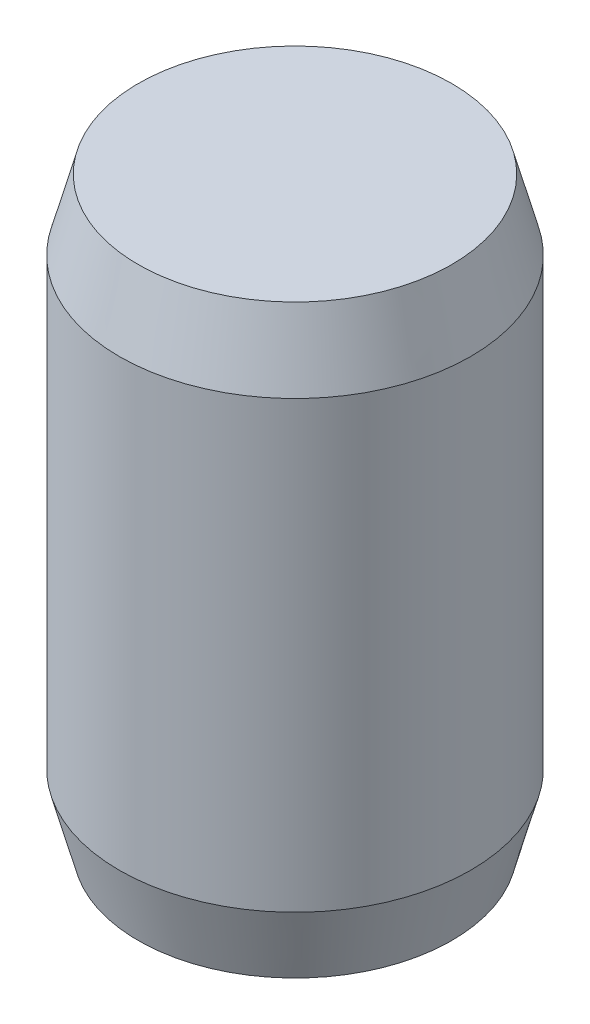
ISO-10303-21;
HEADER;
FILE_DESCRIPTION(('STEP AP214'),'2;1');
FILE_NAME('part.step','',(''),(''),'','','');
FILE_SCHEMA(('AUTOMOTIVE_DESIGN { 1 0 10303 214 1 1 1 1 }'));
ENDSEC;
DATA;
#1=APPLICATION_CONTEXT('core data for automotive mechanical design processes');
#2=APPLICATION_PROTOCOL_DEFINITION('international standard','automotive_design',2000,#1);
#3=PRODUCT_CONTEXT('',#1,'mechanical');
#4=PRODUCT('Part','Part','',(#3));
#5=PRODUCT_RELATED_PRODUCT_CATEGORY('part','',(#4));
#6=PRODUCT_DEFINITION_FORMATION('','',#4);
#7=PRODUCT_DEFINITION_CONTEXT('part definition',#1,'design');
#8=PRODUCT_DEFINITION('design','',#6,#7);
#9=PRODUCT_DEFINITION_SHAPE('','',#8);
#10=(LENGTH_UNIT() NAMED_UNIT(*) SI_UNIT(.MILLI.,.METRE.));
#11=(NAMED_UNIT(*) PLANE_ANGLE_UNIT() SI_UNIT($,.RADIAN.));
#12=(NAMED_UNIT(*) SI_UNIT($,.STERADIAN.) SOLID_ANGLE_UNIT());
#13=UNCERTAINTY_MEASURE_WITH_UNIT(LENGTH_MEASURE(1.E-05),#10,'distance_accuracy_value','');
#14=(GEOMETRIC_REPRESENTATION_CONTEXT(3) GLOBAL_UNCERTAINTY_ASSIGNED_CONTEXT((#13)) GLOBAL_UNIT_ASSIGNED_CONTEXT((#10,
#11,#12)) REPRESENTATION_CONTEXT('',''));
#15=CARTESIAN_POINT('',(0.,0.,0.));
#16=DIRECTION('',(0.,0.,1.));
#17=DIRECTION('',(1.,0.,0.));
#18=AXIS2_PLACEMENT_3D('',#15,#16,#17);
#19=CARTESIAN_POINT('',(0.,-10.,0.));
#20=DIRECTION('',(0.,1.,0.));
#21=DIRECTION('',(0.,0.,1.));
#22=AXIS2_PLACEMENT_3D('',#19,#20,#21);
#23=CONICAL_SURFACE('',#22,2.67846096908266,0.261799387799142);
#24=CARTESIAN_POINT('',(0.,-8.8,0.));
#25=DIRECTION('',(0.,-1.,0.));
#26=DIRECTION('',(0.,0.,-1.));
#27=AXIS2_PLACEMENT_3D('',#24,#25,#26);
#28=CIRCLE('',#27,3.);
#29=CARTESIAN_POINT('',(0.,-8.8,-3.));
#30=VERTEX_POINT('',#29);
#31=EDGE_CURVE('E10',#30,#30,#28,.T.);
#32=ORIENTED_EDGE('',*,*,#31,.T.);
#33=EDGE_LOOP('',(#32));
#34=FACE_BOUND('',#33,.T.);
#35=CARTESIAN_POINT('',(0.,-10.,0.));
#36=DIRECTION('',(0.,-1.,0.));
#37=DIRECTION('',(0.,0.,-1.));
#38=AXIS2_PLACEMENT_3D('',#35,#36,#37);
#39=CIRCLE('',#38,2.67846096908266);
#40=CARTESIAN_POINT('',(0.,-10.,-2.67846096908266));
#41=VERTEX_POINT('',#40);
#42=EDGE_CURVE('E47',#41,#41,#39,.T.);
#43=ORIENTED_EDGE('',*,*,#42,.F.);
#44=EDGE_LOOP('',(#43));
#45=FACE_BOUND('',#44,.T.);
#46=ADVANCED_FACE('F33',(#34,#45),#23,.T.);
#47=CARTESIAN_POINT('',(0.,0.,0.));
#48=DIRECTION('',(0.,-1.,0.));
#49=DIRECTION('',(0.,0.,-1.));
#50=AXIS2_PLACEMENT_3D('',#47,#48,#49);
#51=CYLINDRICAL_SURFACE('',#50,3.);
#52=CARTESIAN_POINT('',(0.,-1.2,0.));
#53=DIRECTION('',(0.,-1.,0.));
#54=DIRECTION('',(0.,0.,-1.));
#55=AXIS2_PLACEMENT_3D('',#52,#53,#54);
#56=CIRCLE('',#55,3.00000000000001);
#57=CARTESIAN_POINT('',(0.,-1.2,-3.00000000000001));
#58=VERTEX_POINT('',#57);
#59=EDGE_CURVE('E39',#58,#58,#56,.T.);
#60=ORIENTED_EDGE('',*,*,#59,.T.);
#61=EDGE_LOOP('',(#60));
#62=FACE_BOUND('',#61,.T.);
#63=ORIENTED_EDGE('',*,*,#31,.F.);
#64=EDGE_LOOP('',(#63));
#65=FACE_BOUND('',#64,.T.);
#66=ADVANCED_FACE('F56',(#62,#65),#51,.T.);
#67=CARTESIAN_POINT('',(0.,-1.2,0.));
#68=DIRECTION('',(0.,-1.,0.));
#69=DIRECTION('',(0.,0.,-1.));
#70=AXIS2_PLACEMENT_3D('',#67,#68,#69);
#71=CONICAL_SURFACE('',#70,3.00000000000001,0.26179938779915);
#72=CARTESIAN_POINT('',(0.,0.,0.));
#73=DIRECTION('',(0.,-1.,0.));
#74=DIRECTION('',(0.,0.,-1.));
#75=AXIS2_PLACEMENT_3D('',#72,#73,#74);
#76=CIRCLE('',#75,2.67846096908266);
#77=CARTESIAN_POINT('',(0.,0.,-2.67846096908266));
#78=VERTEX_POINT('',#77);
#79=EDGE_CURVE('E43',#78,#78,#76,.T.);
#80=ORIENTED_EDGE('',*,*,#79,.T.);
#81=EDGE_LOOP('',(#80));
#82=FACE_BOUND('',#81,.T.);
#83=ORIENTED_EDGE('',*,*,#59,.F.);
#84=EDGE_LOOP('',(#83));
#85=FACE_BOUND('',#84,.T.);
#86=ADVANCED_FACE('F60',(#82,#85),#71,.T.);
#87=CARTESIAN_POINT('',(0.,0.,0.));
#88=DIRECTION('',(0.,1.,0.));
#89=DIRECTION('',(0.,0.,1.));
#90=AXIS2_PLACEMENT_3D('',#87,#88,#89);
#91=PLANE('',#90);
#92=ORIENTED_EDGE('',*,*,#79,.F.);
#93=EDGE_LOOP('',(#92));
#94=FACE_BOUND('',#93,.T.);
#95=ADVANCED_FACE('F64',(#94),#91,.T.);
#96=CARTESIAN_POINT('',(0.,-10.,0.));
#97=DIRECTION('',(0.,-1.,0.));
#98=DIRECTION('',(0.,0.,-1.));
#99=AXIS2_PLACEMENT_3D('',#96,#97,#98);
#100=PLANE('',#99);
#101=ORIENTED_EDGE('',*,*,#42,.T.);
#102=EDGE_LOOP('',(#101));
#103=FACE_BOUND('',#102,.T.);
#104=ADVANCED_FACE('F53',(#103),#100,.T.);
#105=CLOSED_SHELL('',(#46,#66,#86,#95,#104));
#106=MANIFOLD_SOLID_BREP('B2',#105);
#107=ADVANCED_BREP_SHAPE_REPRESENTATION('',(#18,#106),#14);
#108=SHAPE_DEFINITION_REPRESENTATION(#9,#107);
ENDSEC;
END-ISO-10303-21;
